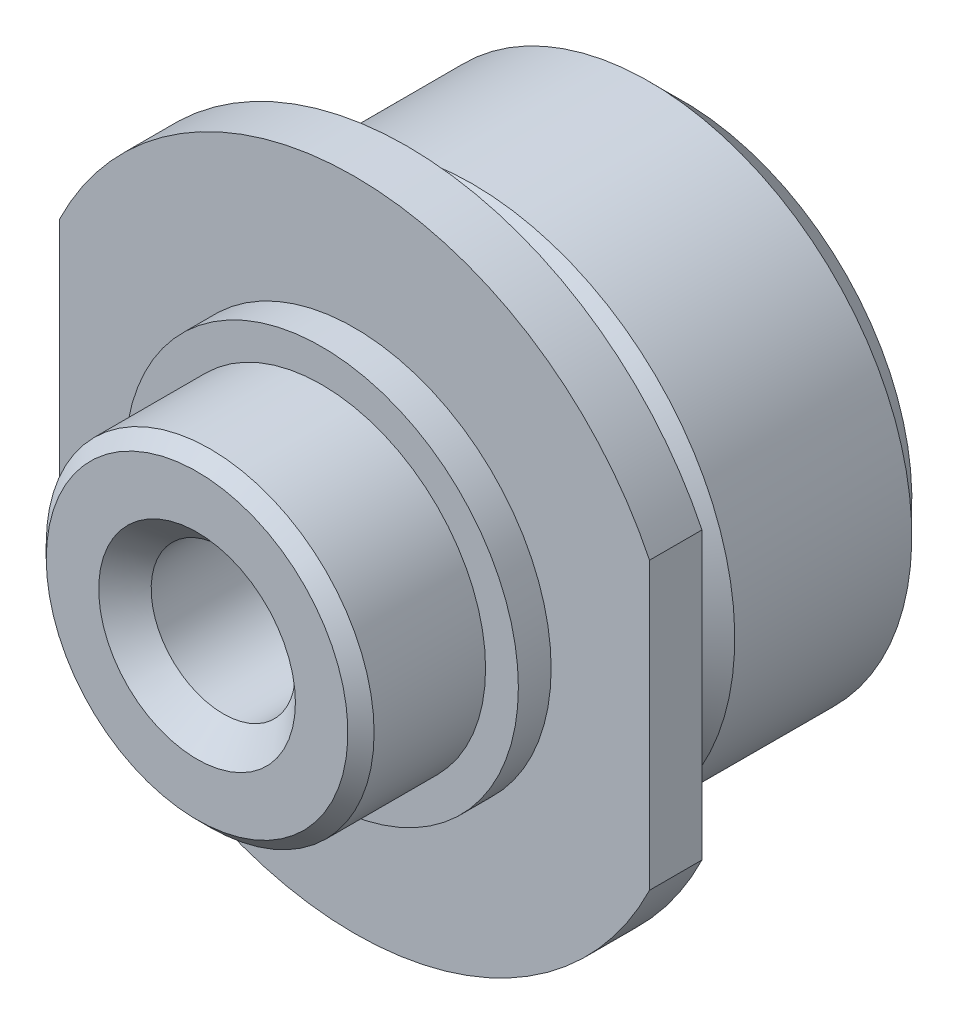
ISO-10303-21;
HEADER;
FILE_DESCRIPTION(('STEP AP214'),'2;1');
FILE_NAME('part.step','',(''),(''),'','','');
FILE_SCHEMA(('AUTOMOTIVE_DESIGN { 1 0 10303 214 1 1 1 1 }'));
ENDSEC;
DATA;
#1=APPLICATION_CONTEXT('core data for automotive mechanical design processes');
#2=APPLICATION_PROTOCOL_DEFINITION('international standard','automotive_design',2000,#1);
#3=PRODUCT_CONTEXT('',#1,'mechanical');
#4=PRODUCT('Part','Part','',(#3));
#5=PRODUCT_RELATED_PRODUCT_CATEGORY('part','',(#4));
#6=PRODUCT_DEFINITION_FORMATION('','',#4);
#7=PRODUCT_DEFINITION_CONTEXT('part definition',#1,'design');
#8=PRODUCT_DEFINITION('design','',#6,#7);
#9=PRODUCT_DEFINITION_SHAPE('','',#8);
#10=(LENGTH_UNIT() NAMED_UNIT(*) SI_UNIT(.MILLI.,.METRE.));
#11=(NAMED_UNIT(*) PLANE_ANGLE_UNIT() SI_UNIT($,.RADIAN.));
#12=(NAMED_UNIT(*) SI_UNIT($,.STERADIAN.) SOLID_ANGLE_UNIT());
#13=UNCERTAINTY_MEASURE_WITH_UNIT(LENGTH_MEASURE(1.E-05),#10,'distance_accuracy_value','');
#14=(GEOMETRIC_REPRESENTATION_CONTEXT(3) GLOBAL_UNCERTAINTY_ASSIGNED_CONTEXT((#13)) GLOBAL_UNIT_ASSIGNED_CONTEXT((#10,
#11,#12)) REPRESENTATION_CONTEXT('',''));
#15=CARTESIAN_POINT('',(0.,0.,0.));
#16=DIRECTION('',(0.,0.,1.));
#17=DIRECTION('',(1.,0.,0.));
#18=AXIS2_PLACEMENT_3D('',#15,#16,#17);
#19=CARTESIAN_POINT('',(0.,0.,-4.1999999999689));
#20=DIRECTION('',(0.,0.,-1.));
#21=DIRECTION('',(-1.,0.,0.));
#22=AXIS2_PLACEMENT_3D('',#19,#20,#21);
#23=CONICAL_SURFACE('',#22,1.49999999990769,0.785398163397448);
#24=CARTESIAN_POINT('',(0.,0.,-3.80000000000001));
#25=DIRECTION('',(0.,0.,1.));
#26=DIRECTION('',(1.,0.,0.));
#27=AXIS2_PLACEMENT_3D('',#24,#25,#26);
#28=CIRCLE('',#27,1.1);
#29=CARTESIAN_POINT('',(1.1,0.,-3.80000000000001));
#30=VERTEX_POINT('',#29);
#31=EDGE_CURVE('E104',#30,#30,#28,.T.);
#32=ORIENTED_EDGE('',*,*,#31,.T.);
#33=EDGE_LOOP('',(#32));
#34=FACE_BOUND('',#33,.T.);
#35=CARTESIAN_POINT('',(0.,0.,-4.20000000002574));
#36=DIRECTION('',(0.,0.,-1.));
#37=DIRECTION('',(-1.,0.,0.));
#38=AXIS2_PLACEMENT_3D('',#35,#36,#37);
#39=CIRCLE('',#38,1.49999999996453);
#40=CARTESIAN_POINT('',(-1.49999999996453,0.,-4.20000000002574));
#41=VERTEX_POINT('',#40);
#42=EDGE_CURVE('E18',#41,#41,#39,.F.);
#43=ORIENTED_EDGE('',*,*,#42,.F.);
#44=EDGE_LOOP('',(#43));
#45=FACE_BOUND('',#44,.T.);
#46=ADVANCED_FACE('F15',(#34,#45),#23,.F.);
#47=CARTESIAN_POINT('',(0.,0.,-4.94000240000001));
#48=DIRECTION('',(0.,0.,1.));
#49=DIRECTION('',(1.,0.,0.));
#50=AXIS2_PLACEMENT_3D('',#47,#48,#49);
#51=CYLINDRICAL_SURFACE('',#50,1.1);
#52=ORIENTED_EDGE('',*,*,#31,.F.);
#53=EDGE_LOOP('',(#52));
#54=FACE_BOUND('',#53,.T.);
#55=CARTESIAN_POINT('',(0.,0.,2.79999999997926));
#56=DIRECTION('',(0.,0.,1.));
#57=DIRECTION('',(0.,-1.,0.));
#58=AXIS2_PLACEMENT_3D('',#55,#56,#57);
#59=CIRCLE('',#58,1.10000000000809);
#60=CARTESIAN_POINT('',(0.,-1.10000000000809,2.79999999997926));
#61=VERTEX_POINT('',#60);
#62=EDGE_CURVE('E100',#61,#61,#59,.T.);
#63=ORIENTED_EDGE('',*,*,#62,.T.);
#64=EDGE_LOOP('',(#63));
#65=FACE_BOUND('',#64,.T.);
#66=ADVANCED_FACE('F134',(#54,#65),#51,.F.);
#67=CARTESIAN_POINT('',(-0.0413017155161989,0.190545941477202,-4.20000000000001));
#68=DIRECTION('',(0.,0.,-1.));
#69=DIRECTION('',(-1.,0.,0.));
#70=AXIS2_PLACEMENT_3D('',#67,#68,#69);
#71=PLANE('',#70);
#72=CARTESIAN_POINT('',(0.,0.,-4.20000000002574));
#73=DIRECTION('',(0.,0.,1.));
#74=DIRECTION('',(0.,-1.,0.));
#75=AXIS2_PLACEMENT_3D('',#72,#73,#74);
#76=CIRCLE('',#75,3.49999999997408);
#77=CARTESIAN_POINT('',(0.,-3.49999999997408,-4.20000000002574));
#78=VERTEX_POINT('',#77);
#79=EDGE_CURVE('E103',#78,#78,#76,.T.);
#80=ORIENTED_EDGE('',*,*,#79,.F.);
#81=EDGE_LOOP('',(#80));
#82=FACE_BOUND('',#81,.T.);
#83=ORIENTED_EDGE('',*,*,#42,.T.);
#84=EDGE_LOOP('',(#83));
#85=FACE_BOUND('',#84,.T.);
#86=ADVANCED_FACE('F130',(#82,#85),#71,.T.);
#87=CARTESIAN_POINT('',(0.,0.,3.19999999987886));
#88=DIRECTION('',(0.,0.,1.));
#89=DIRECTION('',(1.,0.,0.));
#90=AXIS2_PLACEMENT_3D('',#87,#88,#89);
#91=CONICAL_SURFACE('',#90,1.49999999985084,0.785398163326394);
#92=ORIENTED_EDGE('',*,*,#62,.F.);
#93=EDGE_LOOP('',(#92));
#94=FACE_BOUND('',#93,.T.);
#95=CARTESIAN_POINT('',(0.,0.,3.1999999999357));
#96=DIRECTION('',(0.,0.,1.));
#97=DIRECTION('',(1.,0.,0.));
#98=AXIS2_PLACEMENT_3D('',#95,#96,#97);
#99=CIRCLE('',#98,1.49999999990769);
#100=CARTESIAN_POINT('',(1.49999999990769,0.,3.1999999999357));
#101=VERTEX_POINT('',#100);
#102=EDGE_CURVE('E99',#101,#101,#99,.F.);
#103=ORIENTED_EDGE('',*,*,#102,.F.);
#104=EDGE_LOOP('',(#103));
#105=FACE_BOUND('',#104,.T.);
#106=ADVANCED_FACE('F133',(#94,#105),#91,.F.);
#107=CARTESIAN_POINT('',(0.,0.,-3.69999999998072));
#108=DIRECTION('',(0.,0.,1.));
#109=DIRECTION('',(0.,-1.,0.));
#110=AXIS2_PLACEMENT_3D('',#107,#108,#109);
#111=CONICAL_SURFACE('',#110,4.00000000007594,0.785398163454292);
#112=ORIENTED_EDGE('',*,*,#79,.T.);
#113=EDGE_LOOP('',(#112));
#114=FACE_BOUND('',#113,.T.);
#115=CARTESIAN_POINT('',(0.,0.,-3.70000000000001));
#116=DIRECTION('',(0.,0.,-1.));
#117=DIRECTION('',(-1.,0.,0.));
#118=AXIS2_PLACEMENT_3D('',#115,#116,#117);
#119=CIRCLE('',#118,4.);
#120=CARTESIAN_POINT('',(-4.,0.,-3.70000000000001));
#121=VERTEX_POINT('',#120);
#122=EDGE_CURVE('E96',#121,#121,#119,.F.);
#123=ORIENTED_EDGE('',*,*,#122,.F.);
#124=EDGE_LOOP('',(#123));
#125=FACE_BOUND('',#124,.T.);
#126=ADVANCED_FACE('F127',(#114,#125),#111,.T.);
#127=CARTESIAN_POINT('',(1.0323590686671,0.243913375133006,3.2));
#128=DIRECTION('',(0.,0.,1.));
#129=DIRECTION('',(1.,0.,0.));
#130=AXIS2_PLACEMENT_3D('',#127,#128,#129);
#131=PLANE('',#130);
#132=CARTESIAN_POINT('',(0.,0.,3.1999999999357));
#133=DIRECTION('',(0.,0.,-1.));
#134=DIRECTION('',(-1.,0.,0.));
#135=AXIS2_PLACEMENT_3D('',#132,#133,#134);
#136=CIRCLE('',#135,2.30000000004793);
#137=CARTESIAN_POINT('',(-2.30000000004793,0.,3.1999999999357));
#138=VERTEX_POINT('',#137);
#139=EDGE_CURVE('E95',#138,#138,#136,.T.);
#140=ORIENTED_EDGE('',*,*,#139,.F.);
#141=EDGE_LOOP('',(#140));
#142=FACE_BOUND('',#141,.T.);
#143=ORIENTED_EDGE('',*,*,#102,.T.);
#144=EDGE_LOOP('',(#143));
#145=FACE_BOUND('',#144,.T.);
#146=ADVANCED_FACE('F194',(#142,#145),#131,.T.);
#147=CARTESIAN_POINT('',(0.,0.,0.));
#148=DIRECTION('',(0.,0.,-1.));
#149=DIRECTION('',(-1.,0.,0.));
#150=AXIS2_PLACEMENT_3D('',#147,#148,#149);
#151=CYLINDRICAL_SURFACE('',#150,4.);
#152=ORIENTED_EDGE('',*,*,#122,.T.);
#153=EDGE_LOOP('',(#152));
#154=FACE_BOUND('',#153,.T.);
#155=CARTESIAN_POINT('',(0.,0.,-1.0000000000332));
#156=DIRECTION('',(0.,0.,-1.));
#157=DIRECTION('',(0.,1.,0.));
#158=AXIS2_PLACEMENT_3D('',#155,#156,#157);
#159=CIRCLE('',#158,3.99999999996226);
#160=CARTESIAN_POINT('',(0.,3.99999999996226,-1.0000000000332));
#161=VERTEX_POINT('',#160);
#162=EDGE_CURVE('E92',#161,#161,#159,.F.);
#163=ORIENTED_EDGE('',*,*,#162,.F.);
#164=EDGE_LOOP('',(#163));
#165=FACE_BOUND('',#164,.T.);
#166=ADVANCED_FACE('F190',(#154,#165),#151,.T.);
#167=CARTESIAN_POINT('',(0.,0.,3.00000000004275));
#168=DIRECTION('',(0.,0.,-1.));
#169=DIRECTION('',(-1.,0.,0.));
#170=AXIS2_PLACEMENT_3D('',#167,#168,#169);
#171=CONICAL_SURFACE('',#170,2.49999999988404,0.78539816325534);
#172=CARTESIAN_POINT('',(0.,0.,3.));
#173=DIRECTION('',(0.,0.,1.));
#174=DIRECTION('',(1.,0.,0.));
#175=AXIS2_PLACEMENT_3D('',#172,#173,#174);
#176=CIRCLE('',#175,2.5);
#177=CARTESIAN_POINT('',(2.5,0.,3.));
#178=VERTEX_POINT('',#177);
#179=EDGE_CURVE('E89',#178,#178,#176,.F.);
#180=ORIENTED_EDGE('',*,*,#179,.F.);
#181=EDGE_LOOP('',(#180));
#182=FACE_BOUND('',#181,.T.);
#183=ORIENTED_EDGE('',*,*,#139,.T.);
#184=EDGE_LOOP('',(#183));
#185=FACE_BOUND('',#184,.T.);
#186=ADVANCED_FACE('F186',(#182,#185),#171,.T.);
#187=CARTESIAN_POINT('',(0.,0.,-0.99999999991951));
#188=DIRECTION('',(0.,0.,-1.));
#189=DIRECTION('',(-1.,0.,0.));
#190=AXIS2_PLACEMENT_3D('',#187,#188,#189);
#191=CONICAL_SURFACE('',#190,3.99999999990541,0.785398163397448);
#192=ORIENTED_EDGE('',*,*,#162,.T.);
#193=EDGE_LOOP('',(#192));
#194=FACE_BOUND('',#193,.T.);
#195=CARTESIAN_POINT('',(0.,0.,-0.5));
#196=DIRECTION('',(0.,0.,1.));
#197=DIRECTION('',(1.,0.,0.));
#198=AXIS2_PLACEMENT_3D('',#195,#196,#197);
#199=CIRCLE('',#198,3.5);
#200=CARTESIAN_POINT('',(3.5,0.,-0.500000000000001));
#201=VERTEX_POINT('',#200);
#202=EDGE_CURVE('E85',#201,#201,#199,.T.);
#203=ORIENTED_EDGE('',*,*,#202,.F.);
#204=EDGE_LOOP('',(#203));
#205=FACE_BOUND('',#204,.T.);
#206=ADVANCED_FACE('F182',(#194,#205),#191,.T.);
#207=CARTESIAN_POINT('',(0.,0.,1.3));
#208=DIRECTION('',(0.,0.,1.));
#209=DIRECTION('',(1.,0.,0.));
#210=AXIS2_PLACEMENT_3D('',#207,#208,#209);
#211=CYLINDRICAL_SURFACE('',#210,2.5);
#212=ORIENTED_EDGE('',*,*,#179,.T.);
#213=EDGE_LOOP('',(#212));
#214=FACE_BOUND('',#213,.T.);
#215=CARTESIAN_POINT('',(0.,0.,1.3));
#216=DIRECTION('',(0.,0.,1.));
#217=DIRECTION('',(1.,0.,0.));
#218=AXIS2_PLACEMENT_3D('',#215,#216,#217);
#219=CIRCLE('',#218,2.5);
#220=CARTESIAN_POINT('',(2.5,0.,1.3));
#221=VERTEX_POINT('',#220);
#222=EDGE_CURVE('E88',#221,#221,#219,.F.);
#223=ORIENTED_EDGE('',*,*,#222,.F.);
#224=EDGE_LOOP('',(#223));
#225=FACE_BOUND('',#224,.T.);
#226=ADVANCED_FACE('F178',(#214,#225),#211,.T.);
#227=CARTESIAN_POINT('',(0.,0.,0.));
#228=DIRECTION('',(0.,0.,1.));
#229=DIRECTION('',(1.,0.,0.));
#230=AXIS2_PLACEMENT_3D('',#227,#228,#229);
#231=CYLINDRICAL_SURFACE('',#230,3.5);
#232=ORIENTED_EDGE('',*,*,#202,.T.);
#233=EDGE_LOOP('',(#232));
#234=FACE_BOUND('',#233,.T.);
#235=CARTESIAN_POINT('',(0.,0.,0.));
#236=DIRECTION('',(0.,0.,1.));
#237=DIRECTION('',(1.,0.,0.));
#238=AXIS2_PLACEMENT_3D('',#235,#236,#237);
#239=CIRCLE('',#238,3.5);
#240=CARTESIAN_POINT('',(3.5,0.,0.));
#241=VERTEX_POINT('',#240);
#242=EDGE_CURVE('E116',#241,#241,#239,.T.);
#243=ORIENTED_EDGE('',*,*,#242,.F.);
#244=EDGE_LOOP('',(#243));
#245=FACE_BOUND('',#244,.T.);
#246=ADVANCED_FACE('F174',(#234,#245),#231,.T.);
#247=CARTESIAN_POINT('',(1.4489210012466,-0.556678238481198,1.3));
#248=DIRECTION('',(0.,0.,1.));
#249=DIRECTION('',(1.,0.,0.));
#250=AXIS2_PLACEMENT_3D('',#247,#248,#249);
#251=PLANE('',#250);
#252=CARTESIAN_POINT('',(0.,0.,1.3));
#253=DIRECTION('',(0.,0.,1.));
#254=DIRECTION('',(1.,0.,0.));
#255=AXIS2_PLACEMENT_3D('',#252,#253,#254);
#256=CIRCLE('',#255,3.);
#257=CARTESIAN_POINT('',(3.,0.,1.3));
#258=VERTEX_POINT('',#257);
#259=EDGE_CURVE('E84',#258,#258,#256,.F.);
#260=ORIENTED_EDGE('',*,*,#259,.F.);
#261=EDGE_LOOP('',(#260));
#262=FACE_BOUND('',#261,.T.);
#263=ORIENTED_EDGE('',*,*,#222,.T.);
#264=EDGE_LOOP('',(#263));
#265=FACE_BOUND('',#264,.T.);
#266=ADVANCED_FACE('F171',(#262,#265),#251,.T.);
#267=CARTESIAN_POINT('',(3.2196414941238,-2.3613369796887,0.));
#268=DIRECTION('',(0.,0.,-1.));
#269=DIRECTION('',(-1.,0.,0.));
#270=AXIS2_PLACEMENT_3D('',#267,#268,#269);
#271=PLANE('',#270);
#272=CARTESIAN_POINT('',(0.,0.,0.));
#273=DIRECTION('',(0.,0.,1.));
#274=DIRECTION('',(1.,0.,0.));
#275=AXIS2_PLACEMENT_3D('',#272,#273,#274);
#276=CIRCLE('',#275,5.);
#277=CARTESIAN_POINT('',(-4.5,-2.17944947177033,0.));
#278=VERTEX_POINT('',#277);
#279=CARTESIAN_POINT('',(4.5,-2.17944947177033,0.));
#280=VERTEX_POINT('',#279);
#281=EDGE_CURVE('E64',#278,#280,#276,.T.);
#282=ORIENTED_EDGE('',*,*,#281,.F.);
#283=DIRECTION('',(0.,1.,0.));
#284=VECTOR('',#283,1.);
#285=CARTESIAN_POINT('',(-4.5,5.3725822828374,0.));
#286=LINE('',#285,#284);
#287=CARTESIAN_POINT('',(-4.5,2.17944947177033,0.));
#288=VERTEX_POINT('',#287);
#289=EDGE_CURVE('E57',#278,#288,#286,.T.);
#290=ORIENTED_EDGE('',*,*,#289,.T.);
#291=CARTESIAN_POINT('',(0.,0.,0.));
#292=DIRECTION('',(0.,0.,1.));
#293=DIRECTION('',(1.,0.,0.));
#294=AXIS2_PLACEMENT_3D('',#291,#292,#293);
#295=CIRCLE('',#294,5.);
#296=CARTESIAN_POINT('',(4.5,2.17944947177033,0.));
#297=VERTEX_POINT('',#296);
#298=EDGE_CURVE('E61',#297,#288,#295,.T.);
#299=ORIENTED_EDGE('',*,*,#298,.F.);
#300=DIRECTION('',(0.,1.,0.));
#301=VECTOR('',#300,1.);
#302=CARTESIAN_POINT('',(4.5,-5.8745794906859,0.));
#303=LINE('',#302,#301);
#304=EDGE_CURVE('E52',#297,#280,#303,.F.);
#305=ORIENTED_EDGE('',*,*,#304,.T.);
#306=EDGE_LOOP('',(#282,#290,#299,#305));
#307=FACE_BOUND('',#306,.T.);
#308=ORIENTED_EDGE('',*,*,#242,.T.);
#309=EDGE_LOOP('',(#308));
#310=FACE_BOUND('',#309,.T.);
#311=ADVANCED_FACE('F59',(#307,#310),#271,.T.);
#312=CARTESIAN_POINT('',(0.,0.,0.8));
#313=DIRECTION('',(0.,0.,1.));
#314=DIRECTION('',(1.,0.,0.));
#315=AXIS2_PLACEMENT_3D('',#312,#313,#314);
#316=CYLINDRICAL_SURFACE('',#315,3.);
#317=ORIENTED_EDGE('',*,*,#259,.T.);
#318=EDGE_LOOP('',(#317));
#319=FACE_BOUND('',#318,.T.);
#320=CARTESIAN_POINT('',(0.,0.,0.8));
#321=DIRECTION('',(0.,0.,1.));
#322=DIRECTION('',(1.,0.,0.));
#323=AXIS2_PLACEMENT_3D('',#320,#321,#322);
#324=CIRCLE('',#323,3.);
#325=CARTESIAN_POINT('',(3.,0.,0.8));
#326=VERTEX_POINT('',#325);
#327=EDGE_CURVE('E110',#326,#326,#324,.F.);
#328=ORIENTED_EDGE('',*,*,#327,.F.);
#329=EDGE_LOOP('',(#328));
#330=FACE_BOUND('',#329,.T.);
#331=ADVANCED_FACE('F165',(#319,#330),#316,.T.);
#332=CARTESIAN_POINT('',(4.5,-5.8745794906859,-4.94000240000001));
#333=DIRECTION('',(-1.,0.,0.));
#334=DIRECTION('',(0.,0.,1.));
#335=AXIS2_PLACEMENT_3D('',#332,#333,#334);
#336=PLANE('',#335);
#337=DIRECTION('',(0.,0.,1.));
#338=VECTOR('',#337,1.);
#339=CARTESIAN_POINT('',(4.50000000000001,-2.17944947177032,0.));
#340=LINE('',#339,#338);
#341=CARTESIAN_POINT('',(4.5,-2.17944947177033,0.799999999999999));
#342=VERTEX_POINT('',#341);
#343=EDGE_CURVE('E76',#280,#342,#340,.T.);
#344=ORIENTED_EDGE('',*,*,#343,.F.);
#345=ORIENTED_EDGE('',*,*,#304,.F.);
#346=DIRECTION('',(0.,0.,1.));
#347=VECTOR('',#346,1.);
#348=CARTESIAN_POINT('',(4.50000000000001,2.17944947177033,0.));
#349=LINE('',#348,#347);
#350=CARTESIAN_POINT('',(4.5,2.17944947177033,0.799999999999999));
#351=VERTEX_POINT('',#350);
#352=EDGE_CURVE('E71',#351,#297,#349,.F.);
#353=ORIENTED_EDGE('',*,*,#352,.F.);
#354=DIRECTION('',(0.,1.,0.));
#355=VECTOR('',#354,1.);
#356=CARTESIAN_POINT('',(4.5,5.172740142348,0.8));
#357=LINE('',#356,#355);
#358=EDGE_CURVE('E109',#342,#351,#357,.T.);
#359=ORIENTED_EDGE('',*,*,#358,.F.);
#360=EDGE_LOOP('',(#344,#345,#353,#359));
#361=FACE_BOUND('',#360,.T.);
#362=ADVANCED_FACE('F162',(#361),#336,.F.);
#363=CARTESIAN_POINT('',(0.,0.,0.));
#364=DIRECTION('',(0.,0.,1.));
#365=DIRECTION('',(1.,0.,0.));
#366=AXIS2_PLACEMENT_3D('',#363,#364,#365);
#367=CYLINDRICAL_SURFACE('',#366,5.);
#368=DIRECTION('',(0.,0.,-1.));
#369=VECTOR('',#368,1.);
#370=CARTESIAN_POINT('',(-4.5,2.17944947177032,-4.94000240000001));
#371=LINE('',#370,#369);
#372=CARTESIAN_POINT('',(-4.5,2.17944947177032,0.800000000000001));
#373=VERTEX_POINT('',#372);
#374=EDGE_CURVE('E66',#288,#373,#371,.F.);
#375=ORIENTED_EDGE('',*,*,#374,.T.);
#376=CARTESIAN_POINT('',(0.,0.,0.8));
#377=DIRECTION('',(0.,0.,1.));
#378=DIRECTION('',(1.,0.,0.));
#379=AXIS2_PLACEMENT_3D('',#376,#377,#378);
#380=CIRCLE('',#379,5.);
#381=EDGE_CURVE('E107',#351,#373,#380,.T.);
#382=ORIENTED_EDGE('',*,*,#381,.F.);
#383=ORIENTED_EDGE('',*,*,#352,.T.);
#384=ORIENTED_EDGE('',*,*,#298,.T.);
#385=EDGE_LOOP('',(#375,#382,#383,#384));
#386=FACE_BOUND('',#385,.T.);
#387=ADVANCED_FACE('F69',(#386),#367,.T.);
#388=CARTESIAN_POINT('',(-4.5,5.3725822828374,-4.94000240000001));
#389=DIRECTION('',(1.,0.,0.));
#390=DIRECTION('',(0.,0.,-1.));
#391=AXIS2_PLACEMENT_3D('',#388,#389,#390);
#392=PLANE('',#391);
#393=ORIENTED_EDGE('',*,*,#374,.F.);
#394=ORIENTED_EDGE('',*,*,#289,.F.);
#395=DIRECTION('',(0.,0.,1.));
#396=VECTOR('',#395,1.);
#397=CARTESIAN_POINT('',(-4.50000000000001,-2.17944947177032,0.));
#398=LINE('',#397,#396);
#399=CARTESIAN_POINT('',(-4.50000000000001,-2.17944947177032,0.8));
#400=VERTEX_POINT('',#399);
#401=EDGE_CURVE('E33',#400,#278,#398,.F.);
#402=ORIENTED_EDGE('',*,*,#401,.F.);
#403=DIRECTION('',(0.,1.,0.));
#404=VECTOR('',#403,1.);
#405=CARTESIAN_POINT('',(-4.50000000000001,5.172740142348,0.800000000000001));
#406=LINE('',#405,#404);
#407=EDGE_CURVE('E24',#373,#400,#406,.F.);
#408=ORIENTED_EDGE('',*,*,#407,.F.);
#409=EDGE_LOOP('',(#393,#394,#402,#408));
#410=FACE_BOUND('',#409,.T.);
#411=ADVANCED_FACE('F73',(#410),#392,.F.);
#412=CARTESIAN_POINT('',(0.,0.,0.));
#413=DIRECTION('',(0.,0.,1.));
#414=DIRECTION('',(1.,0.,0.));
#415=AXIS2_PLACEMENT_3D('',#412,#413,#414);
#416=CYLINDRICAL_SURFACE('',#415,5.);
#417=ORIENTED_EDGE('',*,*,#401,.T.);
#418=ORIENTED_EDGE('',*,*,#281,.T.);
#419=ORIENTED_EDGE('',*,*,#343,.T.);
#420=CARTESIAN_POINT('',(0.,0.,0.799999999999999));
#421=DIRECTION('',(0.,0.,1.));
#422=DIRECTION('',(1.,0.,0.));
#423=AXIS2_PLACEMENT_3D('',#420,#421,#422);
#424=CIRCLE('',#423,5.);
#425=EDGE_CURVE('E9',#400,#342,#424,.T.);
#426=ORIENTED_EDGE('',*,*,#425,.F.);
#427=EDGE_LOOP('',(#417,#418,#419,#426));
#428=FACE_BOUND('',#427,.T.);
#429=ADVANCED_FACE('F148',(#428),#416,.T.);
#430=CARTESIAN_POINT('',(-0.306071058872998,5.172740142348,0.8));
#431=DIRECTION('',(0.,0.,1.));
#432=DIRECTION('',(1.,0.,0.));
#433=AXIS2_PLACEMENT_3D('',#430,#431,#432);
#434=PLANE('',#433);
#435=ORIENTED_EDGE('',*,*,#407,.T.);
#436=ORIENTED_EDGE('',*,*,#425,.T.);
#437=ORIENTED_EDGE('',*,*,#358,.T.);
#438=ORIENTED_EDGE('',*,*,#381,.T.);
#439=EDGE_LOOP('',(#435,#436,#437,#438));
#440=FACE_BOUND('',#439,.T.);
#441=ORIENTED_EDGE('',*,*,#327,.T.);
#442=EDGE_LOOP('',(#441));
#443=FACE_BOUND('',#442,.T.);
#444=ADVANCED_FACE('F146',(#440,#443),#434,.T.);
#445=CLOSED_SHELL('',(#46,#66,#86,#106,#126,#146,#166,#186,#206,#226,#246,#266,#311,#331,#362,
#387,#411,#429,#444));
#446=MANIFOLD_SOLID_BREP('B1',#445);
#447=ADVANCED_BREP_SHAPE_REPRESENTATION('',(#18,#446),#14);
#448=SHAPE_DEFINITION_REPRESENTATION(#9,#447);
ENDSEC;
END-ISO-10303-21;
